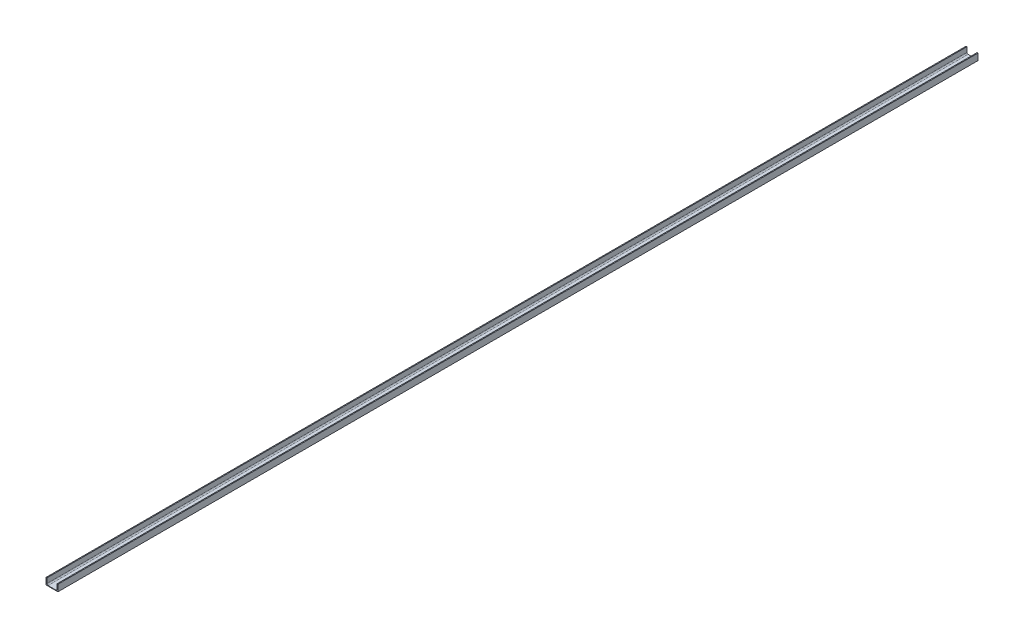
from build123d import *

# Parameters (mm, degrees)
EXTRUSION1_DEPTH        = 7710
ESQUISSE2_R             = 7.5
ENL_V_MAT_EXTRU_1_DEPTH = 10


with BuildPart() as part:
    # Esquisse1 → Extrusion1 (new body)
    with BuildSketch(Plane.XY):
        with BuildLine():
            Line((0, 0), (100, 0))
            Line((100, 0), (100, 55))
            Line((100, 55), (92.5, 55))
            Line((92.5, 55), (92.5, 14.5))
            ThreePointArc((92.5, 14.5), (89.571067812, 7.428932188), (82.5, 4.5))
            Line((82.5, 4.5), (17.5, 4.5))
            ThreePointArc((17.5, 4.5), (10.428932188, 7.428932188), (7.5, 14.5))
            Line((7.5, 14.5), (7.5, 55))
            Line((7.5, 55), (0, 55))
            Line((0, 55), (0, 0))
        make_face()
    extrude(amount=EXTRUSION1_DEPTH)

    # Esquisse2 → Enl_v. mat.-Extru.1 (cut)
    with BuildSketch(Plane.XZ):
        with Locations(Location((70, 150, 0), (0, 0, 270))):
            Circle(ESQUISSE2_R)
        with Locations(Location((70, 540, 0), (0, 0, 270))):
            Circle(ESQUISSE2_R)
        with Locations(Location((70, 930, 0), (0, 0, 270))):
            Circle(ESQUISSE2_R)
        with Locations(Location((70, 1320, 0), (0, 0, 270))):
            Circle(ESQUISSE2_R)
        with Locations(Location((70, 1710, 0), (0, 0, 270))):
            Circle(ESQUISSE2_R)
        with Locations(Location((70, 2100, 0), (0, 0, 270))):
            Circle(ESQUISSE2_R)
        with Locations(Location((70, 2490, 0), (0, 0, 270))):
            Circle(ESQUISSE2_R)
        with Locations(Location((70, 2880, 0), (0, 0, 270))):
            Circle(ESQUISSE2_R)
        with Locations(Location((70, 3270, 0), (0, 0, 270))):
            Circle(ESQUISSE2_R)
        with Locations(Location((70, 3660, 0), (0, 0, 270))):
            Circle(ESQUISSE2_R)
        with Locations(Location((70, 4050, 0), (0, 0, 270))):
            Circle(ESQUISSE2_R)
        with Locations(Location((70, 4440, 0), (0, 0, 270))):
            Circle(ESQUISSE2_R)
        with Locations(Location((70, 4830, 0), (0, 0, 270))):
            Circle(ESQUISSE2_R)
        with Locations(Location((70, 5220, 0), (0, 0, 270))):
            Circle(ESQUISSE2_R)
        with Locations(Location((70, 5610, 0), (0, 0, 270))):
            Circle(ESQUISSE2_R)
        with Locations(Location((70, 6000, 0), (0, 0, 270))):
            Circle(ESQUISSE2_R)
        with Locations(Location((70, 6390, 0), (0, 0, 270))):
            Circle(ESQUISSE2_R)
        with Locations(Location((70, 6780, 0), (0, 0, 270))):
            Circle(ESQUISSE2_R)
        with Locations(Location((70, 7170, 0), (0, 0, 270))):
            Circle(ESQUISSE2_R)
        with Locations(Location((70, 7560, 0), (0, 0, 270))):
            Circle(ESQUISSE2_R)
    extrude(amount=-ENL_V_MAT_EXTRU_1_DEPTH, mode=Mode.SUBTRACT)


solid = part.part
